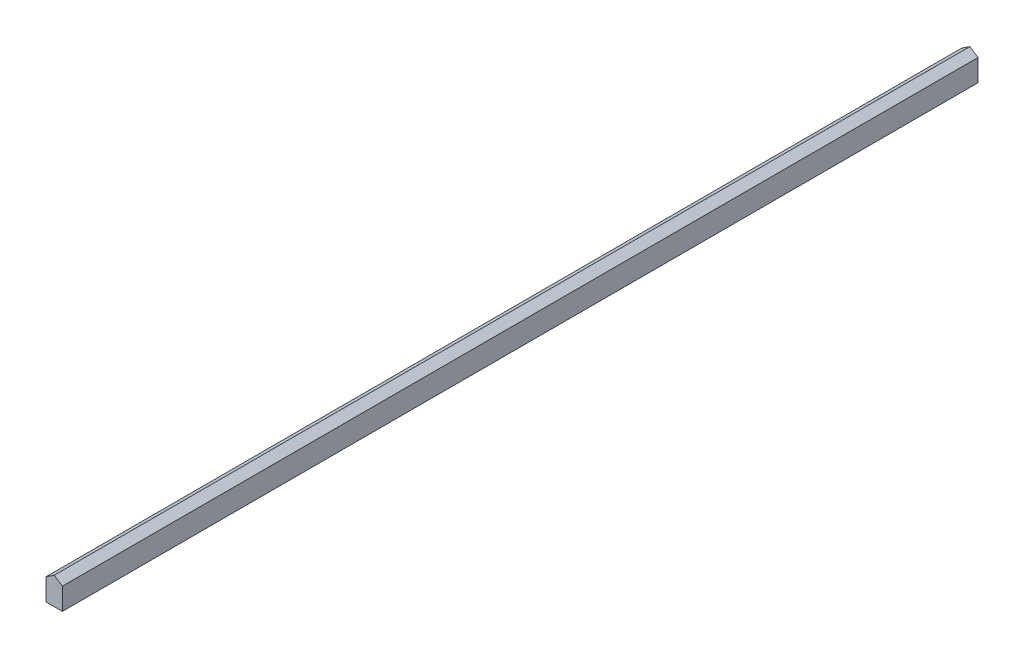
ISO-10303-21;
HEADER;
FILE_DESCRIPTION(('STEP AP214'),'2;1');
FILE_NAME('part.step','',(''),(''),'','','');
FILE_SCHEMA(('AUTOMOTIVE_DESIGN { 1 0 10303 214 1 1 1 1 }'));
ENDSEC;
DATA;
#1=APPLICATION_CONTEXT('core data for automotive mechanical design processes');
#2=APPLICATION_PROTOCOL_DEFINITION('international standard','automotive_design',2000,#1);
#3=PRODUCT_CONTEXT('',#1,'mechanical');
#4=PRODUCT('Part','Part','',(#3));
#5=PRODUCT_RELATED_PRODUCT_CATEGORY('part','',(#4));
#6=PRODUCT_DEFINITION_FORMATION('','',#4);
#7=PRODUCT_DEFINITION_CONTEXT('part definition',#1,'design');
#8=PRODUCT_DEFINITION('design','',#6,#7);
#9=PRODUCT_DEFINITION_SHAPE('','',#8);
#10=(LENGTH_UNIT() NAMED_UNIT(*) SI_UNIT(.MILLI.,.METRE.));
#11=(NAMED_UNIT(*) PLANE_ANGLE_UNIT() SI_UNIT($,.RADIAN.));
#12=(NAMED_UNIT(*) SI_UNIT($,.STERADIAN.) SOLID_ANGLE_UNIT());
#13=UNCERTAINTY_MEASURE_WITH_UNIT(LENGTH_MEASURE(1.E-05),#10,'distance_accuracy_value','');
#14=(GEOMETRIC_REPRESENTATION_CONTEXT(3) GLOBAL_UNCERTAINTY_ASSIGNED_CONTEXT((#13)) GLOBAL_UNIT_ASSIGNED_CONTEXT((#10,
#11,#12)) REPRESENTATION_CONTEXT('',''));
#15=CARTESIAN_POINT('',(0.,0.,0.));
#16=DIRECTION('',(0.,0.,1.));
#17=DIRECTION('',(1.,0.,0.));
#18=AXIS2_PLACEMENT_3D('',#15,#16,#17);
#19=CARTESIAN_POINT('',(0.,0.,840.));
#20=DIRECTION('',(1.,0.,0.));
#21=DIRECTION('',(0.,0.,-1.));
#22=AXIS2_PLACEMENT_3D('',#19,#20,#21);
#23=PLANE('',#22);
#24=DIRECTION('',(0.,-1.,0.));
#25=VECTOR('',#24,1.);
#26=CARTESIAN_POINT('',(0.,0.,840.));
#27=LINE('',#26,#25);
#28=CARTESIAN_POINT('',(0.,20.0384615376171,840.));
#29=VERTEX_POINT('',#28);
#30=CARTESIAN_POINT('',(0.,0.,840.));
#31=VERTEX_POINT('',#30);
#32=EDGE_CURVE('E93',#29,#31,#27,.T.);
#33=ORIENTED_EDGE('',*,*,#32,.F.);
#34=DIRECTION('',(0.,0.,1.));
#35=VECTOR('',#34,1.);
#36=CARTESIAN_POINT('',(0.,20.0384615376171,0.));
#37=LINE('',#36,#35);
#38=CARTESIAN_POINT('',(0.,20.0384615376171,0.));
#39=VERTEX_POINT('',#38);
#40=EDGE_CURVE('E88',#39,#29,#37,.T.);
#41=ORIENTED_EDGE('',*,*,#40,.F.);
#42=DIRECTION('',(0.,-1.,0.));
#43=VECTOR('',#42,1.);
#44=CARTESIAN_POINT('',(0.,0.,0.));
#45=LINE('',#44,#43);
#46=CARTESIAN_POINT('',(0.,0.,0.));
#47=VERTEX_POINT('',#46);
#48=EDGE_CURVE('E100',#39,#47,#45,.T.);
#49=ORIENTED_EDGE('',*,*,#48,.T.);
#50=DIRECTION('',(0.,0.,-1.));
#51=VECTOR('',#50,1.);
#52=CARTESIAN_POINT('',(0.,0.,840.));
#53=LINE('',#52,#51);
#54=EDGE_CURVE('E11',#31,#47,#53,.T.);
#55=ORIENTED_EDGE('',*,*,#54,.F.);
#56=EDGE_LOOP('',(#33,#41,#49,#55));
#57=FACE_BOUND('',#56,.T.);
#58=ADVANCED_FACE('F26',(#57),#23,.F.);
#59=CARTESIAN_POINT('',(0.,0.,840.));
#60=DIRECTION('',(0.,1.,0.));
#61=DIRECTION('',(0.,0.,1.));
#62=AXIS2_PLACEMENT_3D('',#59,#60,#61);
#63=PLANE('',#62);
#64=DIRECTION('',(1.,0.,0.));
#65=VECTOR('',#64,1.);
#66=CARTESIAN_POINT('',(0.,0.,0.));
#67=LINE('',#66,#65);
#68=CARTESIAN_POINT('',(15.,0.,0.));
#69=VERTEX_POINT('',#68);
#70=EDGE_CURVE('E98',#47,#69,#67,.T.);
#71=ORIENTED_EDGE('',*,*,#70,.T.);
#72=DIRECTION('',(0.,0.,-1.));
#73=VECTOR('',#72,1.);
#74=CARTESIAN_POINT('',(15.,0.,840.));
#75=LINE('',#74,#73);
#76=CARTESIAN_POINT('',(15.,0.,840.));
#77=VERTEX_POINT('',#76);
#78=EDGE_CURVE('E33',#77,#69,#75,.T.);
#79=ORIENTED_EDGE('',*,*,#78,.F.);
#80=DIRECTION('',(1.,0.,0.));
#81=VECTOR('',#80,1.);
#82=CARTESIAN_POINT('',(0.,0.,840.));
#83=LINE('',#82,#81);
#84=EDGE_CURVE('E48',#31,#77,#83,.T.);
#85=ORIENTED_EDGE('',*,*,#84,.F.);
#86=ORIENTED_EDGE('',*,*,#54,.T.);
#87=EDGE_LOOP('',(#71,#79,#85,#86));
#88=FACE_BOUND('',#87,.T.);
#89=ADVANCED_FACE('F116',(#88),#63,.F.);
#90=CARTESIAN_POINT('',(15.,0.,840.));
#91=DIRECTION('',(-1.,0.,0.));
#92=DIRECTION('',(0.,0.,1.));
#93=AXIS2_PLACEMENT_3D('',#90,#91,#92);
#94=PLANE('',#93);
#95=DIRECTION('',(0.,1.,0.));
#96=VECTOR('',#95,1.);
#97=CARTESIAN_POINT('',(15.,0.,0.));
#98=LINE('',#97,#96);
#99=CARTESIAN_POINT('',(15.,20.0384615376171,0.));
#100=VERTEX_POINT('',#99);
#101=EDGE_CURVE('E87',#69,#100,#98,.T.);
#102=ORIENTED_EDGE('',*,*,#101,.T.);
#103=DIRECTION('',(0.,0.,1.));
#104=VECTOR('',#103,1.);
#105=CARTESIAN_POINT('',(15.,20.0384615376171,0.));
#106=LINE('',#105,#104);
#107=CARTESIAN_POINT('',(15.,20.0384615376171,840.));
#108=VERTEX_POINT('',#107);
#109=EDGE_CURVE('E74',#100,#108,#106,.T.);
#110=ORIENTED_EDGE('',*,*,#109,.T.);
#111=DIRECTION('',(0.,1.,0.));
#112=VECTOR('',#111,1.);
#113=CARTESIAN_POINT('',(15.,0.,840.));
#114=LINE('',#113,#112);
#115=EDGE_CURVE('E85',#77,#108,#114,.T.);
#116=ORIENTED_EDGE('',*,*,#115,.F.);
#117=ORIENTED_EDGE('',*,*,#78,.T.);
#118=EDGE_LOOP('',(#102,#110,#116,#117));
#119=FACE_BOUND('',#118,.T.);
#120=ADVANCED_FACE('F83',(#119),#94,.F.);
#121=CARTESIAN_POINT('',(0.,25.,840.));
#122=DIRECTION('',(0.,0.,-1.));
#123=DIRECTION('',(-1.,0.,0.));
#124=AXIS2_PLACEMENT_3D('',#121,#122,#123);
#125=PLANE('',#124);
#126=ORIENTED_EDGE('',*,*,#115,.T.);
#127=DIRECTION('',(0.834019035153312,-0.551735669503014,0.));
#128=VECTOR('',#127,1.);
#129=CARTESIAN_POINT('',(7.5,25.,840.));
#130=LINE('',#129,#128);
#131=CARTESIAN_POINT('',(7.5,25.,840.));
#132=VERTEX_POINT('',#131);
#133=EDGE_CURVE('E71',#132,#108,#130,.T.);
#134=ORIENTED_EDGE('',*,*,#133,.F.);
#135=DIRECTION('',(0.834019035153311,0.551735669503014,0.));
#136=VECTOR('',#135,1.);
#137=CARTESIAN_POINT('',(7.5,25.,840.));
#138=LINE('',#137,#136);
#139=EDGE_CURVE('E78',#29,#132,#138,.T.);
#140=ORIENTED_EDGE('',*,*,#139,.F.);
#141=ORIENTED_EDGE('',*,*,#32,.T.);
#142=ORIENTED_EDGE('',*,*,#84,.T.);
#143=EDGE_LOOP('',(#126,#134,#140,#141,#142));
#144=FACE_BOUND('',#143,.T.);
#145=ADVANCED_FACE('F91',(#144),#125,.F.);
#146=CARTESIAN_POINT('',(0.,25.,0.));
#147=DIRECTION('',(0.,0.,-1.));
#148=DIRECTION('',(-1.,0.,0.));
#149=AXIS2_PLACEMENT_3D('',#146,#147,#148);
#150=PLANE('',#149);
#151=DIRECTION('',(0.834019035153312,-0.551735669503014,0.));
#152=VECTOR('',#151,1.);
#153=CARTESIAN_POINT('',(7.5,25.,0.));
#154=LINE('',#153,#152);
#155=CARTESIAN_POINT('',(7.5,25.,0.));
#156=VERTEX_POINT('',#155);
#157=EDGE_CURVE('E40',#156,#100,#154,.T.);
#158=ORIENTED_EDGE('',*,*,#157,.T.);
#159=ORIENTED_EDGE('',*,*,#101,.F.);
#160=ORIENTED_EDGE('',*,*,#70,.F.);
#161=ORIENTED_EDGE('',*,*,#48,.F.);
#162=DIRECTION('',(0.834019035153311,0.551735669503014,0.));
#163=VECTOR('',#162,1.);
#164=CARTESIAN_POINT('',(7.5,25.,0.));
#165=LINE('',#164,#163);
#166=EDGE_CURVE('E89',#39,#156,#165,.T.);
#167=ORIENTED_EDGE('',*,*,#166,.T.);
#168=EDGE_LOOP('',(#158,#159,#160,#161,#167));
#169=FACE_BOUND('',#168,.T.);
#170=ADVANCED_FACE('F118',(#169),#150,.T.);
#171=CARTESIAN_POINT('',(7.5,25.,0.));
#172=DIRECTION('',(-0.551735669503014,-0.834019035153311,0.));
#173=DIRECTION('',(0.834019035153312,-0.551735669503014,0.));
#174=AXIS2_PLACEMENT_3D('',#171,#172,#173);
#175=PLANE('',#174);
#176=ORIENTED_EDGE('',*,*,#133,.T.);
#177=ORIENTED_EDGE('',*,*,#109,.F.);
#178=ORIENTED_EDGE('',*,*,#157,.F.);
#179=DIRECTION('',(0.,0.,1.));
#180=VECTOR('',#179,1.);
#181=CARTESIAN_POINT('',(7.5,25.,0.));
#182=LINE('',#181,#180);
#183=EDGE_CURVE('E75',#156,#132,#182,.T.);
#184=ORIENTED_EDGE('',*,*,#183,.T.);
#185=EDGE_LOOP('',(#176,#177,#178,#184));
#186=FACE_BOUND('',#185,.T.);
#187=ADVANCED_FACE('F73',(#186),#175,.F.);
#188=CARTESIAN_POINT('',(7.5,25.,0.));
#189=DIRECTION('',(0.551735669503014,-0.834019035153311,0.));
#190=DIRECTION('',(0.834019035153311,0.551735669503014,0.));
#191=AXIS2_PLACEMENT_3D('',#188,#189,#190);
#192=PLANE('',#191);
#193=ORIENTED_EDGE('',*,*,#139,.T.);
#194=ORIENTED_EDGE('',*,*,#183,.F.);
#195=ORIENTED_EDGE('',*,*,#166,.F.);
#196=ORIENTED_EDGE('',*,*,#40,.T.);
#197=EDGE_LOOP('',(#193,#194,#195,#196));
#198=FACE_BOUND('',#197,.T.);
#199=ADVANCED_FACE('F108',(#198),#192,.F.);
#200=CLOSED_SHELL('',(#58,#89,#120,#145,#170,#187,#199));
#201=MANIFOLD_SOLID_BREP('B2',#200);
#202=ADVANCED_BREP_SHAPE_REPRESENTATION('',(#18,#201),#14);
#203=SHAPE_DEFINITION_REPRESENTATION(#9,#202);
ENDSEC;
END-ISO-10303-21;
